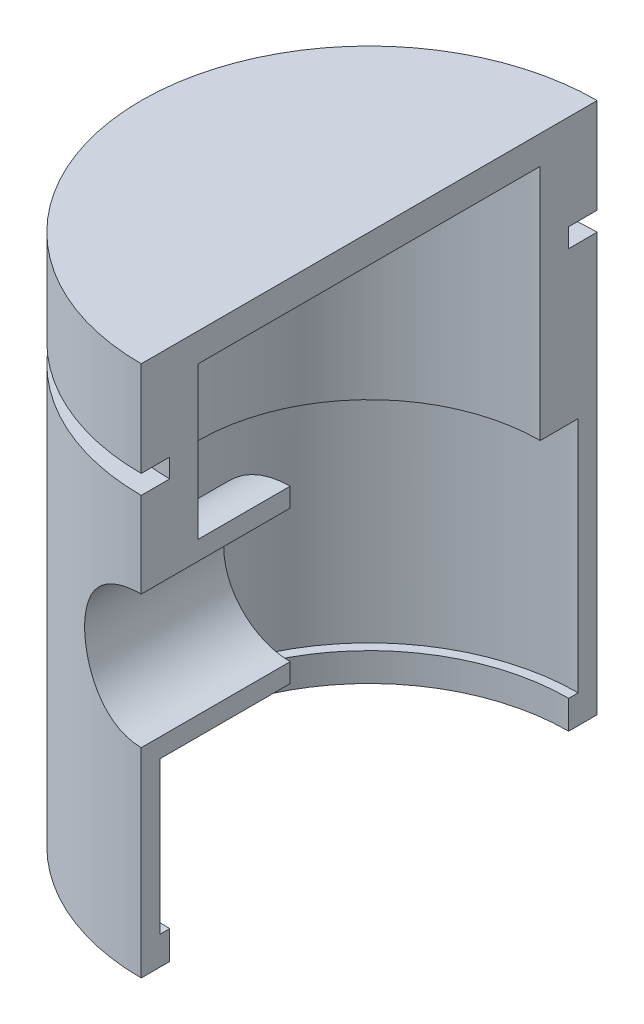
from build123d import *

# Parameters (mm, degrees)
PISTON_ANGLE                 = 180
SALIENTE_CIRCULAR_REACH      = 111.487
SKETCH6_R                    = 11.1125
CORTE_CIRCULAR_LATERAL_DEPTH = 110.4866698
SKETCH7_W                    = 4.7625
SKETCH7_H                    = 3.175


with BuildPart() as part:
    # Sketch1 → Piston (revolve)
    with BuildSketch(Plane(origin=(0, 0, 0), x_dir=(0, 0, -1), z_dir=(1, 0, 0))):
        Polygon((38.1, 88.9), (0, 88.9), (0, 84.1375), (28.575, 84.1375), (28.575, 44.45), (34.925, 44.45), (34.925, 4.7625), (33.3375, 4.7625), (33.3375, 0), (38.1, 0), align=None)
    revolve(axis=Axis((0, 88.9, 0), (0, 1, 0)), revolution_arc=PISTON_ANGLE)

    # Sketch5 → Saliente circular (add, up to next)
    with BuildSketch(Plane.XY.offset(13.208), mode=Mode.PRIVATE) as saliente_circular_sk1:
        with BuildLine():
            Line((0, 30.1625), (0, 58.7375))
            ThreePointArc((0, 58.7375), (-14.2875, 44.45), (0, 30.1625))
        make_face()
    saliente_circular_tool1 = extrude(saliente_circular_sk1.sketch, amount=SALIENTE_CIRCULAR_REACH, mode=Mode.PRIVATE) - part.part
    add(saliente_circular_tool1.solids().sort_by_distance((-6.063803, 44.45, 13.208))[0])

    # Sketch6 → Corte circular lateral (cut, through all)
    with BuildSketch(Plane.XY.offset(13.208)):
        with Locations((0, 44.45)):
            Circle(SKETCH6_R)
    extrude(amount=CORTE_CIRCULAR_LATERAL_DEPTH, mode=Mode.SUBTRACT)

    # Sketch7 → Ranura (revolve, cut)
    with BuildSketch(Plane(origin=(0, 7.447290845, 55.242674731), x_dir=(0, 0, -1), z_dir=(1, 0, 0))):
        with Locations((90.961424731, 63.990209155)):
            Rectangle(SKETCH7_W, SKETCH7_H)
    revolve(axis=Axis((0, 73.025, 0), (0, -1, 0)), mode=Mode.SUBTRACT)


solid = part.part
